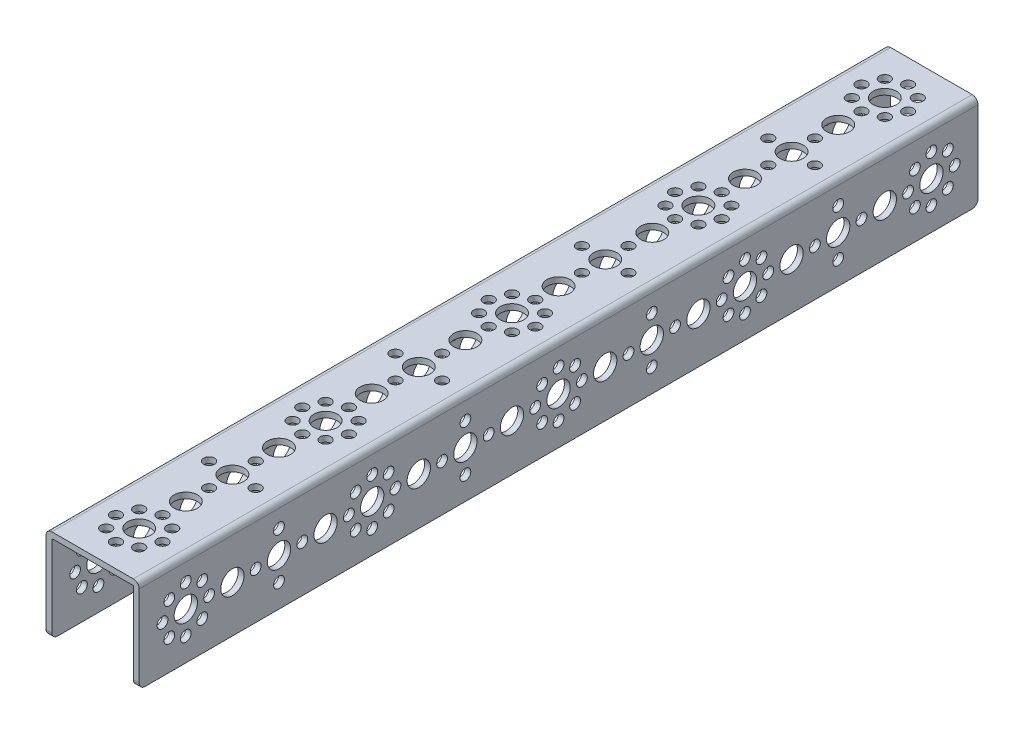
from build123d import *

# Parameters (mm, degrees)
BOSS_EXTRUDE1_DEPTH = 288
SKETCH2_R           = 4
SKETCH2_R_2         = 1.85
CUT_EXTRUDE1_DEPTH  = 291.213714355
SKETCH3_R           = 4
SKETCH3_R_2         = 1.85
CUT_EXTRUDE2_DEPTH  = 291.213714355
FILLET1_R           = 2


with BuildPart() as part:
    # Sketch1 → Boss-Extrude1 (new body)
    with BuildSketch(Plane.XY):
        Polygon((14, -16), (16, -16), (16, 16), (-16, 16), (-16, -16), (-14, -16), (-14, 14), (14, 14), align=None)
    extrude(amount=-BOSS_EXTRUDE1_DEPTH)

    # Sketch2 → Cut-Extrude1 (cut, through all)
    with BuildSketch(Plane(origin=(0, 16, 0), x_dir=(1, 0, 0), z_dir=(0, 1, 0))):
        with Locations(Location((0, 256, 0), (0, 0, 270))):
            Circle(SKETCH2_R)
        with Locations(Location((0, 224, 0), (0, 0, 270))):
            Circle(SKETCH2_R)
        with Locations(Location((0.175415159, 192, 0), (0, 0, 270))):
            Circle(SKETCH2_R)
        with Locations(Location((0, 160, 0), (0, 0, 270))):
            Circle(SKETCH2_R)
        with Locations(Location((0, 240, 0), (0, 0, 270))):
            Circle(SKETCH2_R)
        with Locations(Location((0, 232, 0), (0, 0, 270))):
            Circle(SKETCH2_R_2)
        with Locations(Location((0, 248, 0), (0, 0, 270))):
            Circle(SKETCH2_R_2)
        with Locations(Location((-8, 240, 0), (0, 0, 270))):
            Circle(SKETCH2_R_2)
        with Locations(Location((8, 240, 0), (0, 0, 270))):
            Circle(SKETCH2_R_2)
        with Locations(Location((0, 264, 0), (0, 0, 270))):
            Circle(SKETCH2_R_2)
        with Locations(Location((-8, 272, 0), (0, 0, 270))):
            Circle(SKETCH2_R_2)
        with Locations(Location((0, 272, 0), (0, 0, 270))):
            Circle(SKETCH2_R)
        with Locations(Location((8, 272, 0), (0, 0, 270))):
            Circle(SKETCH2_R_2)
        with Locations(Location((5.66, 277.66, 0), (0, 0, 270))):
            Circle(SKETCH2_R_2)
        with Locations(Location((-5.66, 277.66, 0), (0, 0, 270))):
            Circle(SKETCH2_R_2)
        with Locations(Location((0, 280, 0), (0, 0, 270))):
            Circle(SKETCH2_R_2)
        with Locations(Location((5.66, 266.34, 0), (0, 0, 270))):
            Circle(SKETCH2_R_2)
        with Locations(Location((-5.66, 266.34, 0), (0, 0, 270))):
            Circle(SKETCH2_R_2)
        with Locations(Location((0, 176, 0), (0, 0, 270))):
            Circle(SKETCH2_R)
        with Locations(Location((0, 168, 0), (0, 0, 270))):
            Circle(SKETCH2_R_2)
        with Locations(Location((0, 184, 0), (0, 0, 270))):
            Circle(SKETCH2_R_2)
        with Locations(Location((-8, 176, 0), (0, 0, 270))):
            Circle(SKETCH2_R_2)
        with Locations(Location((8, 176, 0), (0, 0, 270))):
            Circle(SKETCH2_R_2)
        with Locations(Location((0, 200, 0), (0, 0, 270))):
            Circle(SKETCH2_R_2)
        with Locations(Location((-8, 208, 0), (0, 0, 270))):
            Circle(SKETCH2_R_2)
        with Locations(Location((0, 208, 0), (0, 0, 270))):
            Circle(SKETCH2_R)
        with Locations(Location((8, 208, 0), (0, 0, 270))):
            Circle(SKETCH2_R_2)
        with Locations(Location((5.66, 213.66, 0), (0, 0, 270))):
            Circle(SKETCH2_R_2)
        with Locations(Location((-5.66, 213.66, 0), (0, 0, 270))):
            Circle(SKETCH2_R_2)
        with Locations(Location((0, 216, 0), (0, 0, 270))):
            Circle(SKETCH2_R_2)
        with Locations(Location((5.66, 202.34, 0), (0, 0, 270))):
            Circle(SKETCH2_R_2)
        with Locations(Location((-5.66, 202.34, 0), (0, 0, 270))):
            Circle(SKETCH2_R_2)
        with Locations(Location((0, 32, 0), (0, 0, 270))):
            Circle(SKETCH2_R)
        with Locations(Location((0, 64, 0), (0, 0, 270))):
            Circle(SKETCH2_R)
        with Locations(Location((-0.175415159, 96, 0), (0, 0, 270))):
            Circle(SKETCH2_R)
        with Locations(Location((0, 128, 0), (0, 0, 270))):
            Circle(SKETCH2_R)
        with Locations(Location((0, 48, 0), (0, 0, 270))):
            Circle(SKETCH2_R)
        with Locations(Location((0, 56, 0), (0, 0, 270))):
            Circle(SKETCH2_R_2)
        with Locations(Location((0, 40, 0), (0, 0, 270))):
            Circle(SKETCH2_R_2)
        with Locations(Location((8, 48, 0), (0, 0, 270))):
            Circle(SKETCH2_R_2)
        with Locations(Location((-8, 48, 0), (0, 0, 270))):
            Circle(SKETCH2_R_2)
        with Locations(Location((0, 24, 0), (0, 0, 270))):
            Circle(SKETCH2_R_2)
        with Locations(Location((8, 16, 0), (0, 0, 270))):
            Circle(SKETCH2_R_2)
        with Locations(Location((0, 16, 0), (0, 0, 270))):
            Circle(SKETCH2_R)
        with Locations(Location((-8, 16, 0), (0, 0, 270))):
            Circle(SKETCH2_R_2)
        with Locations(Location((-5.66, 10.34, 0), (0, 0, 270))):
            Circle(SKETCH2_R_2)
        with Locations(Location((5.66, 10.34, 0), (0, 0, 270))):
            Circle(SKETCH2_R_2)
        with Locations(Location((0, 8, 0), (0, 0, 270))):
            Circle(SKETCH2_R_2)
        with Locations(Location((-5.66, 21.66, 0), (0, 0, 270))):
            Circle(SKETCH2_R_2)
        with Locations(Location((5.66, 21.66, 0), (0, 0, 270))):
            Circle(SKETCH2_R_2)
        with Locations(Location((0, 112, 0), (0, 0, 270))):
            Circle(SKETCH2_R)
        with Locations(Location((0, 120, 0), (0, 0, 270))):
            Circle(SKETCH2_R_2)
        with Locations(Location((0, 104, 0), (0, 0, 270))):
            Circle(SKETCH2_R_2)
        with Locations(Location((8, 112, 0), (0, 0, 270))):
            Circle(SKETCH2_R_2)
        with Locations(Location((-8, 112, 0), (0, 0, 270))):
            Circle(SKETCH2_R_2)
        with Locations(Location((0, 88, 0), (0, 0, 270))):
            Circle(SKETCH2_R_2)
        with Locations(Location((8, 80, 0), (0, 0, 270))):
            Circle(SKETCH2_R_2)
        with Locations(Location((0, 80, 0), (0, 0, 270))):
            Circle(SKETCH2_R)
        with Locations(Location((-8, 80, 0), (0, 0, 270))):
            Circle(SKETCH2_R_2)
        with Locations(Location((-5.66, 74.34, 0), (0, 0, 270))):
            Circle(SKETCH2_R_2)
        with Locations(Location((5.66, 74.34, 0), (0, 0, 270))):
            Circle(SKETCH2_R_2)
        with Locations(Location((0, 72, 0), (0, 0, 270))):
            Circle(SKETCH2_R_2)
        with Locations(Location((-5.66, 85.66, 0), (0, 0, 270))):
            Circle(SKETCH2_R_2)
        with Locations(Location((5.66, 85.66, 0), (0, 0, 270))):
            Circle(SKETCH2_R_2)
        with Locations(Location((0, 136, 0), (0, 0, 270))):
            Circle(SKETCH2_R_2)
        with Locations(Location((-8, 144, 0), (0, 0, 270))):
            Circle(SKETCH2_R_2)
        with Locations(Location((0, 144, 0), (0, 0, 270))):
            Circle(SKETCH2_R)
        with Locations(Location((8, 144, 0), (0, 0, 270))):
            Circle(SKETCH2_R_2)
        with Locations(Location((5.66, 149.66, 0), (0, 0, 270))):
            Circle(SKETCH2_R_2)
        with Locations(Location((-5.66, 149.66, 0), (0, 0, 270))):
            Circle(SKETCH2_R_2)
        with Locations(Location((0, 152, 0), (0, 0, 270))):
            Circle(SKETCH2_R_2)
        with Locations(Location((5.66, 138.34, 0), (0, 0, 270))):
            Circle(SKETCH2_R_2)
        with Locations(Location((-5.66, 138.34, 0), (0, 0, 270))):
            Circle(SKETCH2_R_2)
    extrude(amount=-CUT_EXTRUDE1_DEPTH, mode=Mode.SUBTRACT)

    # Sketch3 → Cut-Extrude2 (cut, through all)
    with BuildSketch(Plane(origin=(16, 0, 0), x_dir=(0, 0, -1), z_dir=(1, 0, 0))):
        with Locations(Location((32, 0, 0), (0, 0, 90))):
            Circle(SKETCH3_R)
        with Locations(Location((64, 0, 0), (0, 0, 90))):
            Circle(SKETCH3_R)
        with Locations(Location((96, 0.175415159, 0), (0, 0, 90))):
            Circle(SKETCH3_R)
        with Locations(Location((128, 0, 0), (0, 0, 90))):
            Circle(SKETCH3_R)
        with Locations(Location((48, 0, 0), (0, 0, 90))):
            Circle(SKETCH3_R)
        with Locations(Location((56, 0, 0), (0, 0, 90))):
            Circle(SKETCH3_R_2)
        with Locations(Location((40, 0, 0), (0, 0, 90))):
            Circle(SKETCH3_R_2)
        with Locations(Location((48, -8, 0), (0, 0, 90))):
            Circle(SKETCH3_R_2)
        with Locations(Location((48, 8, 0), (0, 0, 90))):
            Circle(SKETCH3_R_2)
        with Locations(Location((24, 0, 0), (0, 0, 90))):
            Circle(SKETCH3_R_2)
        with Locations(Location((16, -8, 0), (0, 0, 90))):
            Circle(SKETCH3_R_2)
        with Locations(Location((16, 0, 0), (0, 0, 90))):
            Circle(SKETCH3_R)
        with Locations(Location((16, 8, 0), (0, 0, 90))):
            Circle(SKETCH3_R_2)
        with Locations(Location((10.34, 5.66, 0), (0, 0, 90))):
            Circle(SKETCH3_R_2)
        with Locations(Location((10.34, -5.66, 0), (0, 0, 90))):
            Circle(SKETCH3_R_2)
        with Locations(Location((8, 0, 0), (0, 0, 90))):
            Circle(SKETCH3_R_2)
        with Locations(Location((21.66, 5.66, 0), (0, 0, 90))):
            Circle(SKETCH3_R_2)
        with Locations(Location((21.66, -5.66, 0), (0, 0, 90))):
            Circle(SKETCH3_R_2)
        with Locations(Location((112, 0, 0), (0, 0, 90))):
            Circle(SKETCH3_R)
        with Locations(Location((120, 0, 0), (0, 0, 90))):
            Circle(SKETCH3_R_2)
        with Locations(Location((104, 0, 0), (0, 0, 90))):
            Circle(SKETCH3_R_2)
        with Locations(Location((112, -8, 0), (0, 0, 90))):
            Circle(SKETCH3_R_2)
        with Locations(Location((112, 8, 0), (0, 0, 90))):
            Circle(SKETCH3_R_2)
        with Locations(Location((88, 0, 0), (0, 0, 90))):
            Circle(SKETCH3_R_2)
        with Locations(Location((80, -8, 0), (0, 0, 90))):
            Circle(SKETCH3_R_2)
        with Locations(Location((80, 0, 0), (0, 0, 90))):
            Circle(SKETCH3_R)
        with Locations(Location((80, 8, 0), (0, 0, 90))):
            Circle(SKETCH3_R_2)
        with Locations(Location((74.34, 5.66, 0), (0, 0, 90))):
            Circle(SKETCH3_R_2)
        with Locations(Location((74.34, -5.66, 0), (0, 0, 90))):
            Circle(SKETCH3_R_2)
        with Locations(Location((72, 0, 0), (0, 0, 90))):
            Circle(SKETCH3_R_2)
        with Locations(Location((85.66, 5.66, 0), (0, 0, 90))):
            Circle(SKETCH3_R_2)
        with Locations(Location((85.66, -5.66, 0), (0, 0, 90))):
            Circle(SKETCH3_R_2)
        with Locations(Location((256, 0, 0), (0, 0, 90))):
            Circle(SKETCH3_R)
        with Locations(Location((224, 0, 0), (0, 0, 90))):
            Circle(SKETCH3_R)
        with Locations(Location((192, -0.175415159, 0), (0, 0, 90))):
            Circle(SKETCH3_R)
        with Locations(Location((160, 0, 0), (0, 0, 90))):
            Circle(SKETCH3_R)
        with Locations(Location((240, 0, 0), (0, 0, 90))):
            Circle(SKETCH3_R)
        with Locations(Location((232, 0, 0), (0, 0, 90))):
            Circle(SKETCH3_R_2)
        with Locations(Location((248, 0, 0), (0, 0, 90))):
            Circle(SKETCH3_R_2)
        with Locations(Location((240, 8, 0), (0, 0, 90))):
            Circle(SKETCH3_R_2)
        with Locations(Location((240, -8, 0), (0, 0, 90))):
            Circle(SKETCH3_R_2)
        with Locations(Location((264, 0, 0), (0, 0, 90))):
            Circle(SKETCH3_R_2)
        with Locations(Location((272, 8, 0), (0, 0, 90))):
            Circle(SKETCH3_R_2)
        with Locations(Location((272, 0, 0), (0, 0, 90))):
            Circle(SKETCH3_R)
        with Locations(Location((272, -8, 0), (0, 0, 90))):
            Circle(SKETCH3_R_2)
        with Locations(Location((277.66, -5.66, 0), (0, 0, 90))):
            Circle(SKETCH3_R_2)
        with Locations(Location((277.66, 5.66, 0), (0, 0, 90))):
            Circle(SKETCH3_R_2)
        with Locations(Location((280, 0, 0), (0, 0, 90))):
            Circle(SKETCH3_R_2)
        with Locations(Location((266.34, -5.66, 0), (0, 0, 90))):
            Circle(SKETCH3_R_2)
        with Locations(Location((266.34, 5.66, 0), (0, 0, 90))):
            Circle(SKETCH3_R_2)
        with Locations(Location((176, 0, 0), (0, 0, 90))):
            Circle(SKETCH3_R)
        with Locations(Location((168, 0, 0), (0, 0, 90))):
            Circle(SKETCH3_R_2)
        with Locations(Location((184, 0, 0), (0, 0, 90))):
            Circle(SKETCH3_R_2)
        with Locations(Location((176, 8, 0), (0, 0, 90))):
            Circle(SKETCH3_R_2)
        with Locations(Location((176, -8, 0), (0, 0, 90))):
            Circle(SKETCH3_R_2)
        with Locations(Location((200, 0, 0), (0, 0, 90))):
            Circle(SKETCH3_R_2)
        with Locations(Location((208, 8, 0), (0, 0, 90))):
            Circle(SKETCH3_R_2)
        with Locations(Location((208, 0, 0), (0, 0, 90))):
            Circle(SKETCH3_R)
        with Locations(Location((208, -8, 0), (0, 0, 90))):
            Circle(SKETCH3_R_2)
        with Locations(Location((213.66, -5.66, 0), (0, 0, 90))):
            Circle(SKETCH3_R_2)
        with Locations(Location((213.66, 5.66, 0), (0, 0, 90))):
            Circle(SKETCH3_R_2)
        with Locations(Location((216, 0, 0), (0, 0, 90))):
            Circle(SKETCH3_R_2)
        with Locations(Location((202.34, -5.66, 0), (0, 0, 90))):
            Circle(SKETCH3_R_2)
        with Locations(Location((202.34, 5.66, 0), (0, 0, 90))):
            Circle(SKETCH3_R_2)
        with Locations(Location((152, 0, 0), (0, 0, 90))):
            Circle(SKETCH3_R_2)
        with Locations(Location((144, -8, 0), (0, 0, 90))):
            Circle(SKETCH3_R_2)
        with Locations(Location((144, 0, 0), (0, 0, 90))):
            Circle(SKETCH3_R)
        with Locations(Location((144, 8, 0), (0, 0, 90))):
            Circle(SKETCH3_R_2)
        with Locations(Location((138.34, 5.66, 0), (0, 0, 90))):
            Circle(SKETCH3_R_2)
        with Locations(Location((138.34, -5.66, 0), (0, 0, 90))):
            Circle(SKETCH3_R_2)
        with Locations(Location((136, 0, 0), (0, 0, 90))):
            Circle(SKETCH3_R_2)
        with Locations(Location((149.66, 5.66, 0), (0, 0, 90))):
            Circle(SKETCH3_R_2)
        with Locations(Location((149.66, -5.66, 0), (0, 0, 90))):
            Circle(SKETCH3_R_2)
    extrude(amount=-CUT_EXTRUDE2_DEPTH, mode=Mode.SUBTRACT)

    # Fillet1
    fillet1_edges = [part.edges().sort_by_distance(p)[0] for p in [
        (-15, -16, -288),
        (-16, 16, -144),
        (16, 16, -144),
        (15, -16, -288),
        (15, -16, 0),
        (-15, -16, 0),
    ]]
    fillet(fillet1_edges, radius=FILLET1_R)


solid = part.part
